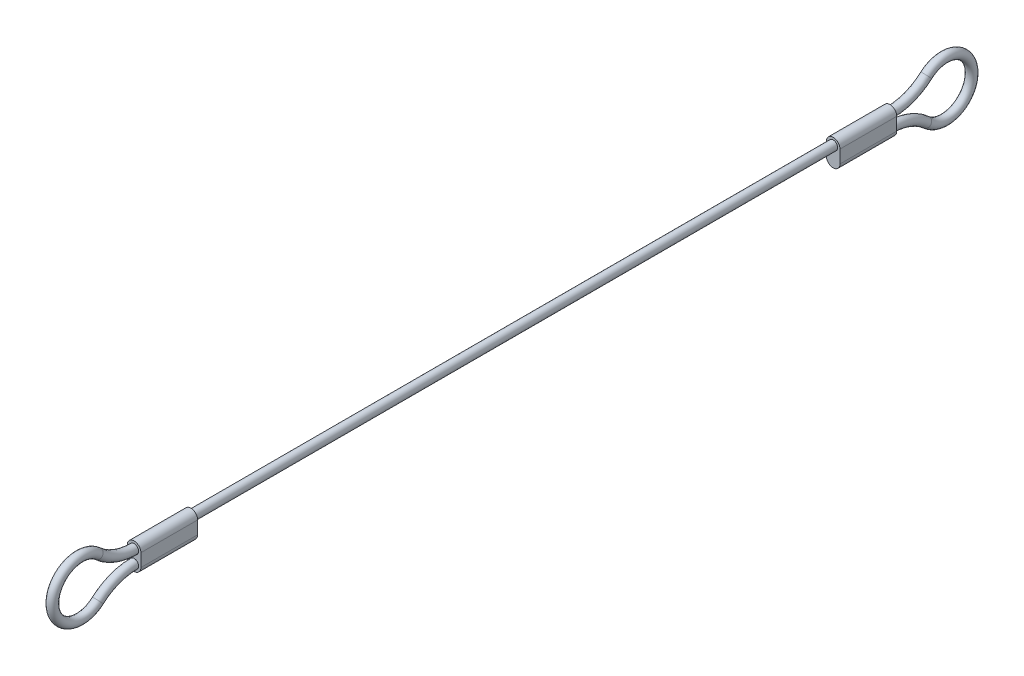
from build123d import *

# Parameters (mm, degrees)
SKETCH2_R           = 0.795
BOSS_EXTRUDE1_DEPTH = 10


with BuildPart() as part:
    # Sweep1: sweep along a path in Sketch1
    with BuildLine(Plane(origin=(0, 0, 0), x_dir=(0, 0, -1), z_dir=(1, 0, 0))) as sweep1_path:
        ThreePointArc((-66.6, -2.266252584), (-70.025492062, -2.898197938), (-73, -4.710835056))
        ThreePointArc((-73, -4.710835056), (-81, -1.133126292), (-73, 2.444582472))
        ThreePointArc((-73, 2.444582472), (-70.025492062, 0.631945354), (-66.6, 0))
        Line((-66.6, 0), (66.6, 0))
        ThreePointArc((66.6, 0), (70.025492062, 0.631945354), (73, 2.444582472))
        ThreePointArc((73, 2.444582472), (81, -1.133126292), (73, -4.710835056))
        ThreePointArc((73, -4.710835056), (70.025492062, -2.898197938), (66.6, -2.266252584))
    # Sketch2 → Sweep1 (sweep)
    with BuildSketch(Plane.XY):
        Circle(SKETCH2_R)
    sweep(path=sweep1_path.line)

    # Sketch3 → Boss-Extrude1 (add)
    with BuildSketch(Plane(origin=(0, 0, 66.6), x_dir=(-1, 0, 0), z_dir=(0, 0, -1))):
        with BuildLine():
            Line((1.2, 0), (1.2, -2.266252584))
            ThreePointArc((1.2, -2.266252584), (0, -3.466252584), (-1.2, -2.266252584))
            Line((-1.2, -2.266252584), (-1.2, 0))
            ThreePointArc((-1.2, 0), (0, 1.2), (1.2, 0))
        make_face()
    boss_extrude1 = extrude(amount=BOSS_EXTRUDE1_DEPTH)

    # Mirror1: Boss-Extrude1 across plane
    add(boss_extrude1.mirror(Plane.XY))


solid = part.part
